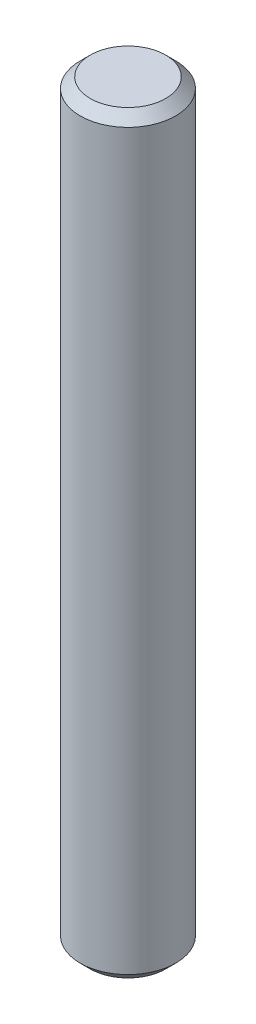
from build123d import *

# Parameters (mm, degrees)
SKETCH_1_R      = 0.95
EXTRUDE_1_DEPTH = 15
CHAMFER_1_SIZE  = 0.2


with BuildPart() as part:
    # Sketch 1 → Extrude 1 (new body)
    with BuildSketch(Plane(origin=(0, 0, 0), x_dir=(1, 0, 0), z_dir=(0, 1, 0))):
        with Locations(Location((0, 0, 0), (0, 0, 270))):
            Circle(SKETCH_1_R)
    extrude(amount=EXTRUDE_1_DEPTH)

    # Chamfer 1
    chamfer_1_edges = [part.edges().sort_by_distance(p)[0] for p in [
        (0, 0, -0.95),
        (0, 15, -0.95),
    ]]
    chamfer(chamfer_1_edges, length=CHAMFER_1_SIZE)


solid = part.part
